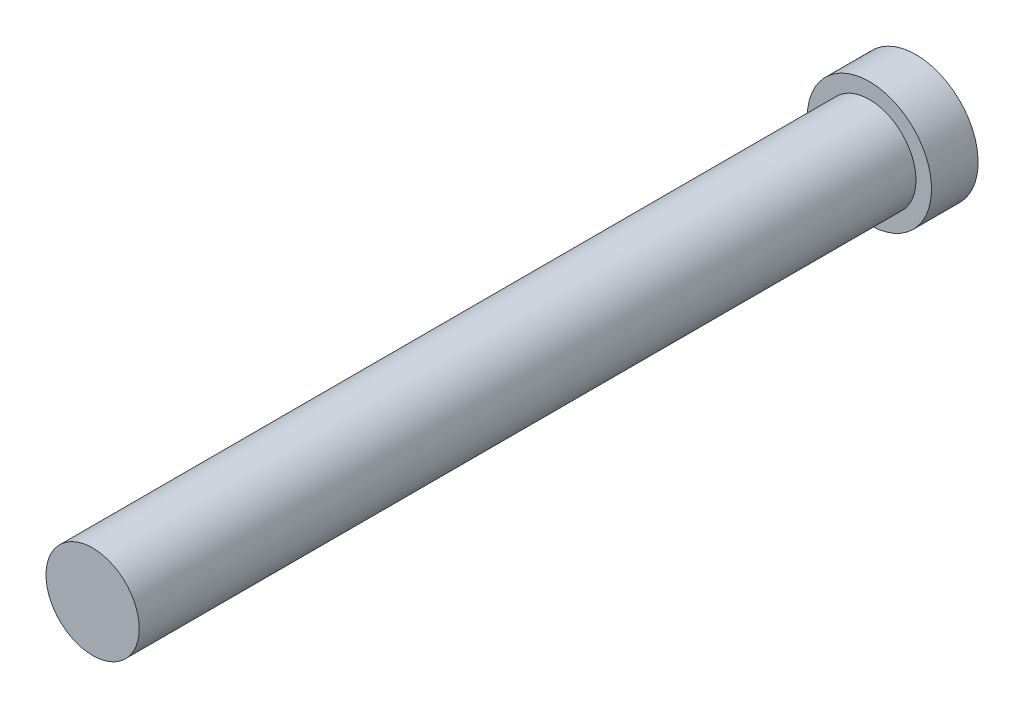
ISO-10303-21;
HEADER;
FILE_DESCRIPTION(('STEP AP214'),'2;1');
FILE_NAME('part.step','',(''),(''),'','','');
FILE_SCHEMA(('AUTOMOTIVE_DESIGN { 1 0 10303 214 1 1 1 1 }'));
ENDSEC;
DATA;
#1=APPLICATION_CONTEXT('core data for automotive mechanical design processes');
#2=APPLICATION_PROTOCOL_DEFINITION('international standard','automotive_design',2000,#1);
#3=PRODUCT_CONTEXT('',#1,'mechanical');
#4=PRODUCT('Part','Part','',(#3));
#5=PRODUCT_RELATED_PRODUCT_CATEGORY('part','',(#4));
#6=PRODUCT_DEFINITION_FORMATION('','',#4);
#7=PRODUCT_DEFINITION_CONTEXT('part definition',#1,'design');
#8=PRODUCT_DEFINITION('design','',#6,#7);
#9=PRODUCT_DEFINITION_SHAPE('','',#8);
#10=(LENGTH_UNIT() NAMED_UNIT(*) SI_UNIT(.MILLI.,.METRE.));
#11=(NAMED_UNIT(*) PLANE_ANGLE_UNIT() SI_UNIT($,.RADIAN.));
#12=(NAMED_UNIT(*) SI_UNIT($,.STERADIAN.) SOLID_ANGLE_UNIT());
#13=UNCERTAINTY_MEASURE_WITH_UNIT(LENGTH_MEASURE(1.E-05),#10,'distance_accuracy_value','');
#14=(GEOMETRIC_REPRESENTATION_CONTEXT(3) GLOBAL_UNCERTAINTY_ASSIGNED_CONTEXT((#13)) GLOBAL_UNIT_ASSIGNED_CONTEXT((#10,
#11,#12)) REPRESENTATION_CONTEXT('',''));
#15=CARTESIAN_POINT('',(0.,0.,0.));
#16=DIRECTION('',(0.,0.,1.));
#17=DIRECTION('',(1.,0.,0.));
#18=AXIS2_PLACEMENT_3D('',#15,#16,#17);
#19=CARTESIAN_POINT('',(0.,0.,25.));
#20=DIRECTION('',(0.,0.,-1.));
#21=DIRECTION('',(-1.,0.,0.));
#22=AXIS2_PLACEMENT_3D('',#19,#20,#21);
#23=CYLINDRICAL_SURFACE('',#22,1.5);
#24=CARTESIAN_POINT('',(0.,0.,25.));
#25=DIRECTION('',(0.,0.,1.));
#26=DIRECTION('',(1.,0.,0.));
#27=AXIS2_PLACEMENT_3D('',#24,#25,#26);
#28=CIRCLE('',#27,1.5);
#29=CARTESIAN_POINT('',(1.5,0.,25.));
#30=VERTEX_POINT('',#29);
#31=EDGE_CURVE('E11',#30,#30,#28,.T.);
#32=ORIENTED_EDGE('',*,*,#31,.F.);
#33=EDGE_LOOP('',(#32));
#34=FACE_BOUND('',#33,.T.);
#35=CARTESIAN_POINT('',(0.,0.,0.));
#36=DIRECTION('',(0.,0.,-1.));
#37=DIRECTION('',(-1.,0.,0.));
#38=AXIS2_PLACEMENT_3D('',#35,#36,#37);
#39=CIRCLE('',#38,1.5);
#40=CARTESIAN_POINT('',(-1.5,0.,0.));
#41=VERTEX_POINT('',#40);
#42=EDGE_CURVE('E40',#41,#41,#39,.T.);
#43=ORIENTED_EDGE('',*,*,#42,.F.);
#44=EDGE_LOOP('',(#43));
#45=FACE_BOUND('',#44,.T.);
#46=ADVANCED_FACE('F33',(#34,#45),#23,.T.);
#47=CARTESIAN_POINT('',(0.,0.,25.));
#48=DIRECTION('',(0.,0.,1.));
#49=DIRECTION('',(1.,0.,0.));
#50=AXIS2_PLACEMENT_3D('',#47,#48,#49);
#51=PLANE('',#50);
#52=ORIENTED_EDGE('',*,*,#31,.T.);
#53=EDGE_LOOP('',(#52));
#54=FACE_BOUND('',#53,.T.);
#55=ADVANCED_FACE('F216',(#54),#51,.T.);
#56=CARTESIAN_POINT('',(0.,0.,0.));
#57=DIRECTION('',(0.,0.,-1.));
#58=DIRECTION('',(-1.,0.,0.));
#59=AXIS2_PLACEMENT_3D('',#56,#57,#58);
#60=PLANE('',#59);
#61=CARTESIAN_POINT('',(0.,0.,0.));
#62=DIRECTION('',(0.,0.,-1.));
#63=DIRECTION('',(-1.,0.,0.));
#64=AXIS2_PLACEMENT_3D('',#61,#62,#63);
#65=CIRCLE('',#64,2.);
#66=CARTESIAN_POINT('',(-2.,0.,0.));
#67=VERTEX_POINT('',#66);
#68=EDGE_CURVE('E188',#67,#67,#65,.T.);
#69=ORIENTED_EDGE('',*,*,#68,.F.);
#70=EDGE_LOOP('',(#69));
#71=FACE_BOUND('',#70,.T.);
#72=ORIENTED_EDGE('',*,*,#42,.T.);
#73=EDGE_LOOP('',(#72));
#74=FACE_BOUND('',#73,.T.);
#75=ADVANCED_FACE('F213',(#71,#74),#60,.F.);
#76=CARTESIAN_POINT('',(0.,0.,-1.5));
#77=DIRECTION('',(0.,0.,1.));
#78=DIRECTION('',(1.,0.,0.));
#79=AXIS2_PLACEMENT_3D('',#76,#77,#78);
#80=CYLINDRICAL_SURFACE('',#79,2.);
#81=CARTESIAN_POINT('',(0.,0.,-1.5));
#82=DIRECTION('',(0.,0.,-1.));
#83=DIRECTION('',(-1.,0.,0.));
#84=AXIS2_PLACEMENT_3D('',#81,#82,#83);
#85=CIRCLE('',#84,2.);
#86=CARTESIAN_POINT('',(-2.,0.,-1.5));
#87=VERTEX_POINT('',#86);
#88=EDGE_CURVE('E206',#87,#87,#85,.T.);
#89=ORIENTED_EDGE('',*,*,#88,.F.);
#90=EDGE_LOOP('',(#89));
#91=FACE_BOUND('',#90,.T.);
#92=ORIENTED_EDGE('',*,*,#68,.T.);
#93=EDGE_LOOP('',(#92));
#94=FACE_BOUND('',#93,.T.);
#95=ADVANCED_FACE('F226',(#91,#94),#80,.T.);
#96=CARTESIAN_POINT('',(0.,0.,-1.5));
#97=DIRECTION('',(0.,0.,-1.));
#98=DIRECTION('',(-1.,0.,0.));
#99=AXIS2_PLACEMENT_3D('',#96,#97,#98);
#100=PLANE('',#99);
#101=DIRECTION('',(0.,-1.,0.));
#102=VECTOR('',#101,1.);
#103=CARTESIAN_POINT('',(1.73567977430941,-0.304992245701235,-1.5));
#104=LINE('',#103,#102);
#105=CARTESIAN_POINT('',(1.73567977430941,0.304992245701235,-1.5));
#106=VERTEX_POINT('',#105);
#107=CARTESIAN_POINT('',(1.73567977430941,-0.304992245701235,-1.5));
#108=VERTEX_POINT('',#107);
#109=EDGE_CURVE('E47',#106,#108,#104,.T.);
#110=ORIENTED_EDGE('',*,*,#109,.F.);
#111=DIRECTION('',(1.,0.,0.));
#112=VECTOR('',#111,1.);
#113=CARTESIAN_POINT('',(0.296795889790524,0.304992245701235,-1.5));
#114=LINE('',#113,#112);
#115=CARTESIAN_POINT('',(0.296795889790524,0.304992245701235,-1.5));
#116=VERTEX_POINT('',#115);
#117=EDGE_CURVE('E184',#116,#106,#114,.T.);
#118=ORIENTED_EDGE('',*,*,#117,.F.);
#119=DIRECTION('',(0.,-1.,0.));
#120=VECTOR('',#119,1.);
#121=CARTESIAN_POINT('',(0.296795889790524,0.304992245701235,-1.5));
#122=LINE('',#121,#120);
#123=CARTESIAN_POINT('',(0.296795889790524,1.68903514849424,-1.5));
#124=VERTEX_POINT('',#123);
#125=EDGE_CURVE('E182',#124,#116,#122,.T.);
#126=ORIENTED_EDGE('',*,*,#125,.F.);
#127=DIRECTION('',(1.,0.,0.));
#128=VECTOR('',#127,1.);
#129=CARTESIAN_POINT('',(-0.296795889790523,1.68903514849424,-1.5));
#130=LINE('',#129,#128);
#131=CARTESIAN_POINT('',(-0.296795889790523,1.68903514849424,-1.5));
#132=VERTEX_POINT('',#131);
#133=EDGE_CURVE('E131',#132,#124,#130,.T.);
#134=ORIENTED_EDGE('',*,*,#133,.F.);
#135=DIRECTION('',(0.,1.,0.));
#136=VECTOR('',#135,1.);
#137=CARTESIAN_POINT('',(-0.296795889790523,0.304992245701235,-1.5));
#138=LINE('',#137,#136);
#139=CARTESIAN_POINT('',(-0.296795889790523,0.304992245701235,-1.5));
#140=VERTEX_POINT('',#139);
#141=EDGE_CURVE('E178',#140,#132,#138,.T.);
#142=ORIENTED_EDGE('',*,*,#141,.F.);
#143=DIRECTION('',(1.,0.,0.));
#144=VECTOR('',#143,1.);
#145=CARTESIAN_POINT('',(-1.73567977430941,0.304992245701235,-1.5));
#146=LINE('',#145,#144);
#147=CARTESIAN_POINT('',(-1.73567977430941,0.304992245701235,-1.5));
#148=VERTEX_POINT('',#147);
#149=EDGE_CURVE('E175',#148,#140,#146,.T.);
#150=ORIENTED_EDGE('',*,*,#149,.F.);
#151=DIRECTION('',(0.,1.,0.));
#152=VECTOR('',#151,1.);
#153=CARTESIAN_POINT('',(-1.73567977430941,-0.304992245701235,-1.5));
#154=LINE('',#153,#152);
#155=CARTESIAN_POINT('',(-1.73567977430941,-0.304992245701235,-1.5));
#156=VERTEX_POINT('',#155);
#157=EDGE_CURVE('E172',#156,#148,#154,.T.);
#158=ORIENTED_EDGE('',*,*,#157,.F.);
#159=DIRECTION('',(-1.,0.,0.));
#160=VECTOR('',#159,1.);
#161=CARTESIAN_POINT('',(-1.73567977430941,-0.304992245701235,-1.5));
#162=LINE('',#161,#160);
#163=CARTESIAN_POINT('',(-0.296795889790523,-0.304992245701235,-1.5));
#164=VERTEX_POINT('',#163);
#165=EDGE_CURVE('E169',#164,#156,#162,.T.);
#166=ORIENTED_EDGE('',*,*,#165,.F.);
#167=DIRECTION('',(0.,1.,0.));
#168=VECTOR('',#167,1.);
#169=CARTESIAN_POINT('',(-0.296795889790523,-1.68903514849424,-1.5));
#170=LINE('',#169,#168);
#171=CARTESIAN_POINT('',(-0.296795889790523,-1.68903514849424,-1.5));
#172=VERTEX_POINT('',#171);
#173=EDGE_CURVE('E166',#172,#164,#170,.T.);
#174=ORIENTED_EDGE('',*,*,#173,.F.);
#175=DIRECTION('',(-1.,0.,0.));
#176=VECTOR('',#175,1.);
#177=CARTESIAN_POINT('',(-0.296795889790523,-1.68903514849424,-1.5));
#178=LINE('',#177,#176);
#179=CARTESIAN_POINT('',(0.296795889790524,-1.68903514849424,-1.5));
#180=VERTEX_POINT('',#179);
#181=EDGE_CURVE('E163',#180,#172,#178,.T.);
#182=ORIENTED_EDGE('',*,*,#181,.F.);
#183=DIRECTION('',(0.,-1.,0.));
#184=VECTOR('',#183,1.);
#185=CARTESIAN_POINT('',(0.296795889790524,-1.68903514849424,-1.5));
#186=LINE('',#185,#184);
#187=CARTESIAN_POINT('',(0.296795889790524,-0.304992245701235,-1.5));
#188=VERTEX_POINT('',#187);
#189=EDGE_CURVE('E160',#188,#180,#186,.T.);
#190=ORIENTED_EDGE('',*,*,#189,.F.);
#191=DIRECTION('',(-1.,0.,0.));
#192=VECTOR('',#191,1.);
#193=CARTESIAN_POINT('',(0.296795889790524,-0.304992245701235,-1.5));
#194=LINE('',#193,#192);
#195=EDGE_CURVE('E157',#108,#188,#194,.T.);
#196=ORIENTED_EDGE('',*,*,#195,.F.);
#197=EDGE_LOOP('',(#110,#118,#126,#134,#142,#150,#158,#166,#174,#182,#190,#196));
#198=FACE_BOUND('',#197,.T.);
#199=ORIENTED_EDGE('',*,*,#88,.T.);
#200=EDGE_LOOP('',(#199));
#201=FACE_BOUND('',#200,.T.);
#202=ADVANCED_FACE('F231',(#198,#201),#100,.T.);
#203=CARTESIAN_POINT('',(1.73567977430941,-0.304992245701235,-0.5));
#204=DIRECTION('',(1.,0.,0.));
#205=DIRECTION('',(0.,0.,-1.));
#206=AXIS2_PLACEMENT_3D('',#203,#204,#205);
#207=PLANE('',#206);
#208=ORIENTED_EDGE('',*,*,#109,.T.);
#209=DIRECTION('',(0.,0.,-1.));
#210=VECTOR('',#209,1.);
#211=CARTESIAN_POINT('',(1.73567977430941,-0.304992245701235,-0.5));
#212=LINE('',#211,#210);
#213=CARTESIAN_POINT('',(1.73567977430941,-0.304992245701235,-0.5));
#214=VERTEX_POINT('',#213);
#215=EDGE_CURVE('E95',#214,#108,#212,.T.);
#216=ORIENTED_EDGE('',*,*,#215,.F.);
#217=DIRECTION('',(0.,-1.,0.));
#218=VECTOR('',#217,1.);
#219=CARTESIAN_POINT('',(1.73567977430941,-0.304992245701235,-0.5));
#220=LINE('',#219,#218);
#221=CARTESIAN_POINT('',(1.73567977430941,0.304992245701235,-0.5));
#222=VERTEX_POINT('',#221);
#223=EDGE_CURVE('E186',#222,#214,#220,.T.);
#224=ORIENTED_EDGE('',*,*,#223,.F.);
#225=DIRECTION('',(0.,0.,-1.));
#226=VECTOR('',#225,1.);
#227=CARTESIAN_POINT('',(1.73567977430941,0.304992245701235,-0.5));
#228=LINE('',#227,#226);
#229=EDGE_CURVE('E55',#222,#106,#228,.T.);
#230=ORIENTED_EDGE('',*,*,#229,.T.);
#231=EDGE_LOOP('',(#208,#216,#224,#230));
#232=FACE_BOUND('',#231,.T.);
#233=ADVANCED_FACE('F236',(#232),#207,.F.);
#234=CARTESIAN_POINT('',(0.296795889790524,0.304992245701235,-0.5));
#235=DIRECTION('',(0.,1.,0.));
#236=DIRECTION('',(-1.,0.,0.));
#237=AXIS2_PLACEMENT_3D('',#234,#235,#236);
#238=PLANE('',#237);
#239=ORIENTED_EDGE('',*,*,#117,.T.);
#240=ORIENTED_EDGE('',*,*,#229,.F.);
#241=DIRECTION('',(1.,0.,0.));
#242=VECTOR('',#241,1.);
#243=CARTESIAN_POINT('',(0.296795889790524,0.304992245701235,-0.5));
#244=LINE('',#243,#242);
#245=CARTESIAN_POINT('',(0.296795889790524,0.304992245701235,-0.5));
#246=VERTEX_POINT('',#245);
#247=EDGE_CURVE('E143',#246,#222,#244,.T.);
#248=ORIENTED_EDGE('',*,*,#247,.F.);
#249=DIRECTION('',(0.,0.,-1.));
#250=VECTOR('',#249,1.);
#251=CARTESIAN_POINT('',(0.296795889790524,0.304992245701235,-0.5));
#252=LINE('',#251,#250);
#253=EDGE_CURVE('E135',#246,#116,#252,.T.);
#254=ORIENTED_EDGE('',*,*,#253,.T.);
#255=EDGE_LOOP('',(#239,#240,#248,#254));
#256=FACE_BOUND('',#255,.T.);
#257=ADVANCED_FACE('F240',(#256),#238,.F.);
#258=CARTESIAN_POINT('',(0.296795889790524,0.304992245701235,-0.5));
#259=DIRECTION('',(1.,0.,0.));
#260=DIRECTION('',(0.,1.,0.));
#261=AXIS2_PLACEMENT_3D('',#258,#259,#260);
#262=PLANE('',#261);
#263=ORIENTED_EDGE('',*,*,#125,.T.);
#264=ORIENTED_EDGE('',*,*,#253,.F.);
#265=DIRECTION('',(0.,-1.,0.));
#266=VECTOR('',#265,1.);
#267=CARTESIAN_POINT('',(0.296795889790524,0.304992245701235,-0.5));
#268=LINE('',#267,#266);
#269=CARTESIAN_POINT('',(0.296795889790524,1.68903514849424,-0.5));
#270=VERTEX_POINT('',#269);
#271=EDGE_CURVE('E139',#270,#246,#268,.T.);
#272=ORIENTED_EDGE('',*,*,#271,.F.);
#273=DIRECTION('',(0.,0.,-1.));
#274=VECTOR('',#273,1.);
#275=CARTESIAN_POINT('',(0.296795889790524,1.68903514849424,-0.5));
#276=LINE('',#275,#274);
#277=EDGE_CURVE('E124',#270,#124,#276,.T.);
#278=ORIENTED_EDGE('',*,*,#277,.T.);
#279=EDGE_LOOP('',(#263,#264,#272,#278));
#280=FACE_BOUND('',#279,.T.);
#281=ADVANCED_FACE('F140',(#280),#262,.F.);
#282=CARTESIAN_POINT('',(-0.296795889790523,1.68903514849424,-0.5));
#283=DIRECTION('',(0.,1.,0.));
#284=DIRECTION('',(0.,0.,1.));
#285=AXIS2_PLACEMENT_3D('',#282,#283,#284);
#286=PLANE('',#285);
#287=ORIENTED_EDGE('',*,*,#133,.T.);
#288=ORIENTED_EDGE('',*,*,#277,.F.);
#289=DIRECTION('',(1.,0.,0.));
#290=VECTOR('',#289,1.);
#291=CARTESIAN_POINT('',(-0.296795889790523,1.68903514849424,-0.5));
#292=LINE('',#291,#290);
#293=CARTESIAN_POINT('',(-0.296795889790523,1.68903514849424,-0.5));
#294=VERTEX_POINT('',#293);
#295=EDGE_CURVE('E128',#294,#270,#292,.T.);
#296=ORIENTED_EDGE('',*,*,#295,.F.);
#297=DIRECTION('',(0.,0.,-1.));
#298=VECTOR('',#297,1.);
#299=CARTESIAN_POINT('',(-0.296795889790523,1.68903514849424,-0.5));
#300=LINE('',#299,#298);
#301=EDGE_CURVE('E136',#294,#132,#300,.T.);
#302=ORIENTED_EDGE('',*,*,#301,.T.);
#303=EDGE_LOOP('',(#287,#288,#296,#302));
#304=FACE_BOUND('',#303,.T.);
#305=ADVANCED_FACE('F126',(#304),#286,.F.);
#306=CARTESIAN_POINT('',(-0.296795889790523,0.304992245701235,-0.5));
#307=DIRECTION('',(-1.,0.,0.));
#308=DIRECTION('',(0.,-1.,0.));
#309=AXIS2_PLACEMENT_3D('',#306,#307,#308);
#310=PLANE('',#309);
#311=ORIENTED_EDGE('',*,*,#141,.T.);
#312=ORIENTED_EDGE('',*,*,#301,.F.);
#313=DIRECTION('',(0.,1.,0.));
#314=VECTOR('',#313,1.);
#315=CARTESIAN_POINT('',(-0.296795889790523,0.304992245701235,-0.5));
#316=LINE('',#315,#314);
#317=CARTESIAN_POINT('',(-0.296795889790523,0.304992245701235,-0.5));
#318=VERTEX_POINT('',#317);
#319=EDGE_CURVE('E149',#318,#294,#316,.T.);
#320=ORIENTED_EDGE('',*,*,#319,.F.);
#321=DIRECTION('',(0.,0.,-1.));
#322=VECTOR('',#321,1.);
#323=CARTESIAN_POINT('',(-0.296795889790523,0.304992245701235,-0.5));
#324=LINE('',#323,#322);
#325=EDGE_CURVE('E191',#318,#140,#324,.T.);
#326=ORIENTED_EDGE('',*,*,#325,.T.);
#327=EDGE_LOOP('',(#311,#312,#320,#326));
#328=FACE_BOUND('',#327,.T.);
#329=ADVANCED_FACE('F268',(#328),#310,.F.);
#330=CARTESIAN_POINT('',(-1.73567977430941,0.304992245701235,-0.5));
#331=DIRECTION('',(0.,1.,0.));
#332=DIRECTION('',(-1.,0.,0.));
#333=AXIS2_PLACEMENT_3D('',#330,#331,#332);
#334=PLANE('',#333);
#335=ORIENTED_EDGE('',*,*,#149,.T.);
#336=ORIENTED_EDGE('',*,*,#325,.F.);
#337=DIRECTION('',(1.,0.,0.));
#338=VECTOR('',#337,1.);
#339=CARTESIAN_POINT('',(-1.73567977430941,0.304992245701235,-0.5));
#340=LINE('',#339,#338);
#341=CARTESIAN_POINT('',(-1.73567977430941,0.304992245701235,-0.5));
#342=VERTEX_POINT('',#341);
#343=EDGE_CURVE('E151',#342,#318,#340,.T.);
#344=ORIENTED_EDGE('',*,*,#343,.F.);
#345=DIRECTION('',(0.,0.,-1.));
#346=VECTOR('',#345,1.);
#347=CARTESIAN_POINT('',(-1.73567977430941,0.304992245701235,-0.5));
#348=LINE('',#347,#346);
#349=EDGE_CURVE('E193',#342,#148,#348,.T.);
#350=ORIENTED_EDGE('',*,*,#349,.T.);
#351=EDGE_LOOP('',(#335,#336,#344,#350));
#352=FACE_BOUND('',#351,.T.);
#353=ADVANCED_FACE('F264',(#352),#334,.F.);
#354=CARTESIAN_POINT('',(-1.73567977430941,-0.304992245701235,-0.5));
#355=DIRECTION('',(-1.,0.,0.));
#356=DIRECTION('',(0.,0.,1.));
#357=AXIS2_PLACEMENT_3D('',#354,#355,#356);
#358=PLANE('',#357);
#359=ORIENTED_EDGE('',*,*,#157,.T.);
#360=ORIENTED_EDGE('',*,*,#349,.F.);
#361=DIRECTION('',(0.,1.,0.));
#362=VECTOR('',#361,1.);
#363=CARTESIAN_POINT('',(-1.73567977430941,-0.304992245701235,-0.5));
#364=LINE('',#363,#362);
#365=CARTESIAN_POINT('',(-1.73567977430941,-0.304992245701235,-0.5));
#366=VERTEX_POINT('',#365);
#367=EDGE_CURVE('E407',#366,#342,#364,.T.);
#368=ORIENTED_EDGE('',*,*,#367,.F.);
#369=DIRECTION('',(0.,0.,-1.));
#370=VECTOR('',#369,1.);
#371=CARTESIAN_POINT('',(-1.73567977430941,-0.304992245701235,-0.5));
#372=LINE('',#371,#370);
#373=EDGE_CURVE('E195',#366,#156,#372,.T.);
#374=ORIENTED_EDGE('',*,*,#373,.T.);
#375=EDGE_LOOP('',(#359,#360,#368,#374));
#376=FACE_BOUND('',#375,.T.);
#377=ADVANCED_FACE('F260',(#376),#358,.F.);
#378=CARTESIAN_POINT('',(-1.73567977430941,-0.304992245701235,-0.5));
#379=DIRECTION('',(0.,-1.,0.));
#380=DIRECTION('',(1.,0.,0.));
#381=AXIS2_PLACEMENT_3D('',#378,#379,#380);
#382=PLANE('',#381);
#383=ORIENTED_EDGE('',*,*,#165,.T.);
#384=ORIENTED_EDGE('',*,*,#373,.F.);
#385=DIRECTION('',(-1.,0.,0.));
#386=VECTOR('',#385,1.);
#387=CARTESIAN_POINT('',(-1.73567977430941,-0.304992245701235,-0.5));
#388=LINE('',#387,#386);
#389=CARTESIAN_POINT('',(-0.296795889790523,-0.304992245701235,-0.5));
#390=VERTEX_POINT('',#389);
#391=EDGE_CURVE('E404',#390,#366,#388,.T.);
#392=ORIENTED_EDGE('',*,*,#391,.F.);
#393=DIRECTION('',(0.,0.,-1.));
#394=VECTOR('',#393,1.);
#395=CARTESIAN_POINT('',(-0.296795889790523,-0.304992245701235,-0.5));
#396=LINE('',#395,#394);
#397=EDGE_CURVE('E197',#390,#164,#396,.T.);
#398=ORIENTED_EDGE('',*,*,#397,.T.);
#399=EDGE_LOOP('',(#383,#384,#392,#398));
#400=FACE_BOUND('',#399,.T.);
#401=ADVANCED_FACE('F256',(#400),#382,.F.);
#402=CARTESIAN_POINT('',(-0.296795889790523,-1.68903514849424,-0.5));
#403=DIRECTION('',(-1.,0.,0.));
#404=DIRECTION('',(0.,-1.,0.));
#405=AXIS2_PLACEMENT_3D('',#402,#403,#404);
#406=PLANE('',#405);
#407=ORIENTED_EDGE('',*,*,#173,.T.);
#408=ORIENTED_EDGE('',*,*,#397,.F.);
#409=DIRECTION('',(0.,1.,0.));
#410=VECTOR('',#409,1.);
#411=CARTESIAN_POINT('',(-0.296795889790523,-1.68903514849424,-0.5));
#412=LINE('',#411,#410);
#413=CARTESIAN_POINT('',(-0.296795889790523,-1.68903514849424,-0.5));
#414=VERTEX_POINT('',#413);
#415=EDGE_CURVE('E401',#414,#390,#412,.T.);
#416=ORIENTED_EDGE('',*,*,#415,.F.);
#417=DIRECTION('',(0.,0.,-1.));
#418=VECTOR('',#417,1.);
#419=CARTESIAN_POINT('',(-0.296795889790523,-1.68903514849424,-0.5));
#420=LINE('',#419,#418);
#421=EDGE_CURVE('E199',#414,#172,#420,.T.);
#422=ORIENTED_EDGE('',*,*,#421,.T.);
#423=EDGE_LOOP('',(#407,#408,#416,#422));
#424=FACE_BOUND('',#423,.T.);
#425=ADVANCED_FACE('F252',(#424),#406,.F.);
#426=CARTESIAN_POINT('',(-0.296795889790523,-1.68903514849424,-0.5));
#427=DIRECTION('',(0.,-1.,0.));
#428=DIRECTION('',(0.,0.,-1.));
#429=AXIS2_PLACEMENT_3D('',#426,#427,#428);
#430=PLANE('',#429);
#431=ORIENTED_EDGE('',*,*,#181,.T.);
#432=ORIENTED_EDGE('',*,*,#421,.F.);
#433=DIRECTION('',(-1.,0.,0.));
#434=VECTOR('',#433,1.);
#435=CARTESIAN_POINT('',(-0.296795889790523,-1.68903514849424,-0.5));
#436=LINE('',#435,#434);
#437=CARTESIAN_POINT('',(0.296795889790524,-1.68903514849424,-0.5));
#438=VERTEX_POINT('',#437);
#439=EDGE_CURVE('E398',#438,#414,#436,.T.);
#440=ORIENTED_EDGE('',*,*,#439,.F.);
#441=DIRECTION('',(0.,0.,-1.));
#442=VECTOR('',#441,1.);
#443=CARTESIAN_POINT('',(0.296795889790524,-1.68903514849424,-0.5));
#444=LINE('',#443,#442);
#445=EDGE_CURVE('E201',#438,#180,#444,.T.);
#446=ORIENTED_EDGE('',*,*,#445,.T.);
#447=EDGE_LOOP('',(#431,#432,#440,#446));
#448=FACE_BOUND('',#447,.T.);
#449=ADVANCED_FACE('F248',(#448),#430,.F.);
#450=CARTESIAN_POINT('',(0.296795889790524,-1.68903514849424,-0.5));
#451=DIRECTION('',(1.,0.,0.));
#452=DIRECTION('',(0.,1.,0.));
#453=AXIS2_PLACEMENT_3D('',#450,#451,#452);
#454=PLANE('',#453);
#455=ORIENTED_EDGE('',*,*,#189,.T.);
#456=ORIENTED_EDGE('',*,*,#445,.F.);
#457=DIRECTION('',(0.,-1.,0.));
#458=VECTOR('',#457,1.);
#459=CARTESIAN_POINT('',(0.296795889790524,-1.68903514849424,-0.5));
#460=LINE('',#459,#458);
#461=CARTESIAN_POINT('',(0.296795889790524,-0.304992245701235,-0.5));
#462=VERTEX_POINT('',#461);
#463=EDGE_CURVE('E393',#462,#438,#460,.T.);
#464=ORIENTED_EDGE('',*,*,#463,.F.);
#465=DIRECTION('',(0.,0.,-1.));
#466=VECTOR('',#465,1.);
#467=CARTESIAN_POINT('',(0.296795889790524,-0.304992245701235,-0.5));
#468=LINE('',#467,#466);
#469=EDGE_CURVE('E203',#462,#188,#468,.T.);
#470=ORIENTED_EDGE('',*,*,#469,.T.);
#471=EDGE_LOOP('',(#455,#456,#464,#470));
#472=FACE_BOUND('',#471,.T.);
#473=ADVANCED_FACE('F244',(#472),#454,.F.);
#474=CARTESIAN_POINT('',(0.296795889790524,-0.304992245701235,-0.5));
#475=DIRECTION('',(0.,-1.,0.));
#476=DIRECTION('',(1.,0.,0.));
#477=AXIS2_PLACEMENT_3D('',#474,#475,#476);
#478=PLANE('',#477);
#479=ORIENTED_EDGE('',*,*,#195,.T.);
#480=ORIENTED_EDGE('',*,*,#469,.F.);
#481=DIRECTION('',(-1.,0.,0.));
#482=VECTOR('',#481,1.);
#483=CARTESIAN_POINT('',(0.296795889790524,-0.304992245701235,-0.5));
#484=LINE('',#483,#482);
#485=EDGE_CURVE('E391',#214,#462,#484,.T.);
#486=ORIENTED_EDGE('',*,*,#485,.F.);
#487=ORIENTED_EDGE('',*,*,#215,.T.);
#488=EDGE_LOOP('',(#479,#480,#486,#487));
#489=FACE_BOUND('',#488,.T.);
#490=ADVANCED_FACE('F241',(#489),#478,.F.);
#491=CARTESIAN_POINT('',(0.,0.,-0.5));
#492=DIRECTION('',(0.,0.,-1.));
#493=DIRECTION('',(-1.,0.,0.));
#494=AXIS2_PLACEMENT_3D('',#491,#492,#493);
#495=PLANE('',#494);
#496=ORIENTED_EDGE('',*,*,#223,.T.);
#497=ORIENTED_EDGE('',*,*,#485,.T.);
#498=ORIENTED_EDGE('',*,*,#463,.T.);
#499=ORIENTED_EDGE('',*,*,#439,.T.);
#500=ORIENTED_EDGE('',*,*,#415,.T.);
#501=ORIENTED_EDGE('',*,*,#391,.T.);
#502=ORIENTED_EDGE('',*,*,#367,.T.);
#503=ORIENTED_EDGE('',*,*,#343,.T.);
#504=ORIENTED_EDGE('',*,*,#319,.T.);
#505=ORIENTED_EDGE('',*,*,#295,.T.);
#506=ORIENTED_EDGE('',*,*,#271,.T.);
#507=ORIENTED_EDGE('',*,*,#247,.T.);
#508=EDGE_LOOP('',(#496,#497,#498,#499,#500,#501,#502,#503,#504,#505,#506,#507));
#509=FACE_BOUND('',#508,.T.);
#510=ADVANCED_FACE('F146',(#509),#495,.T.);
#511=CLOSED_SHELL('',(#46,#55,#75,#95,#202,#233,#257,#281,#305,#329,#353,#377,#401,#425,#449,
#473,#490,#510));
#512=MANIFOLD_SOLID_BREP('B2',#511);
#513=ADVANCED_BREP_SHAPE_REPRESENTATION('',(#18,#512),#14);
#514=SHAPE_DEFINITION_REPRESENTATION(#9,#513);
ENDSEC;
END-ISO-10303-21;
